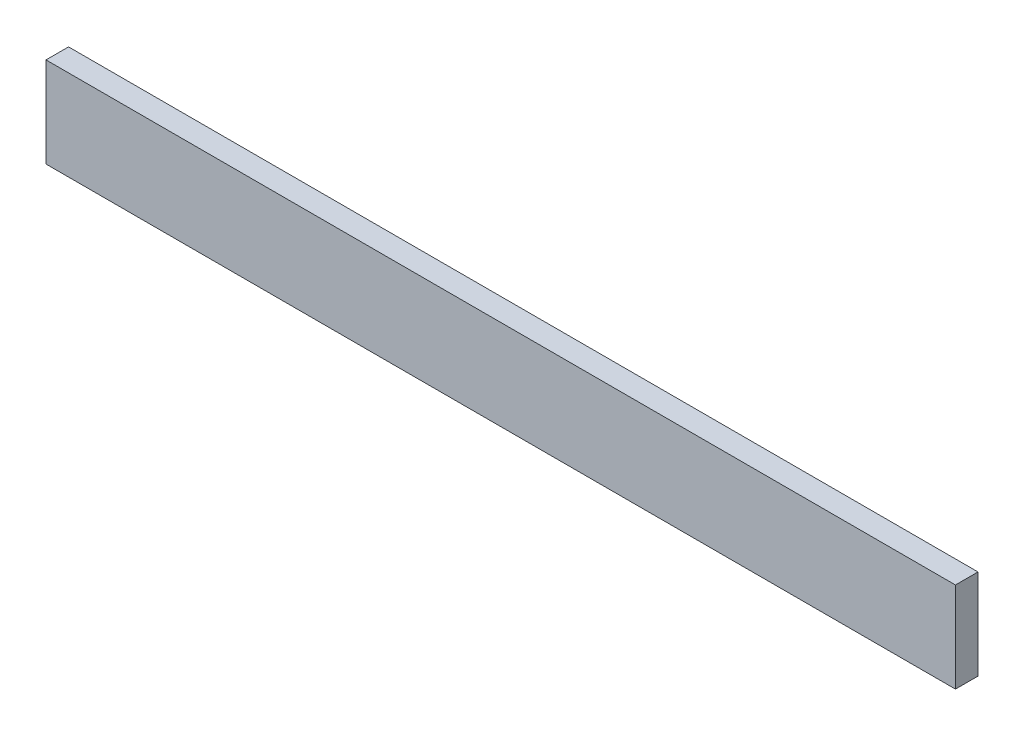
from build123d import *

# Parameters (mm, degrees)
SKETCH1_W           = 504
SKETCH1_H           = 50
BOSS_EXTRUDE1_DEPTH = 12.5


with BuildPart() as part:
    # Sketch1 → Boss-Extrude1 (new body)
    with BuildSketch(Plane.XY):
        Rectangle(SKETCH1_W, SKETCH1_H)
    extrude(amount=BOSS_EXTRUDE1_DEPTH)


solid = part.part
